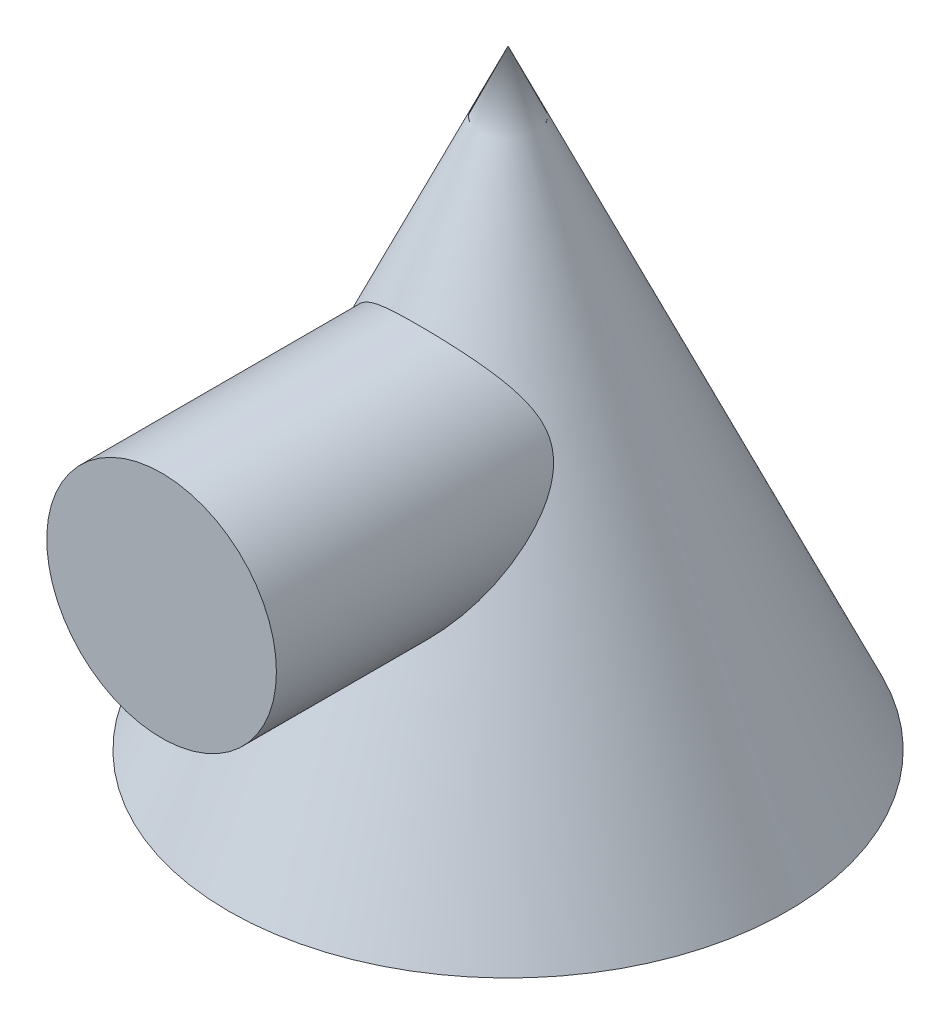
from build123d import *

# Parameters (mm, degrees)
SKETCH_2_R      = 10.274390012
EXTRUDE_1_DEPTH = 30


with BuildPart() as part:
    # Sketch 1 → Revolve 1 (revolve)
    with BuildSketch(Plane.XY, mode=Mode.PRIVATE) as revolve_1_sk:
        Polygon((0, 41.130060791), (-25, -13.413499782), (0, -13.413499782), align=None)
    revolve(revolve_1_sk.sketch.rotate(Axis((0, 58.270588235, 0), (0, -1, 0)), 90), axis=Axis((0, 58.270588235, 0), (0, -1, 0)))

    # Sketch 2 → Extrude 1 (add)
    with BuildSketch(Plane.XY.offset(1)):
        with Locations(Location((0, 13.274726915, 0), (0, 0, 211.663555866))):
            Circle(SKETCH_2_R)
    extrude(amount=EXTRUDE_1_DEPTH)


solid = part.part
